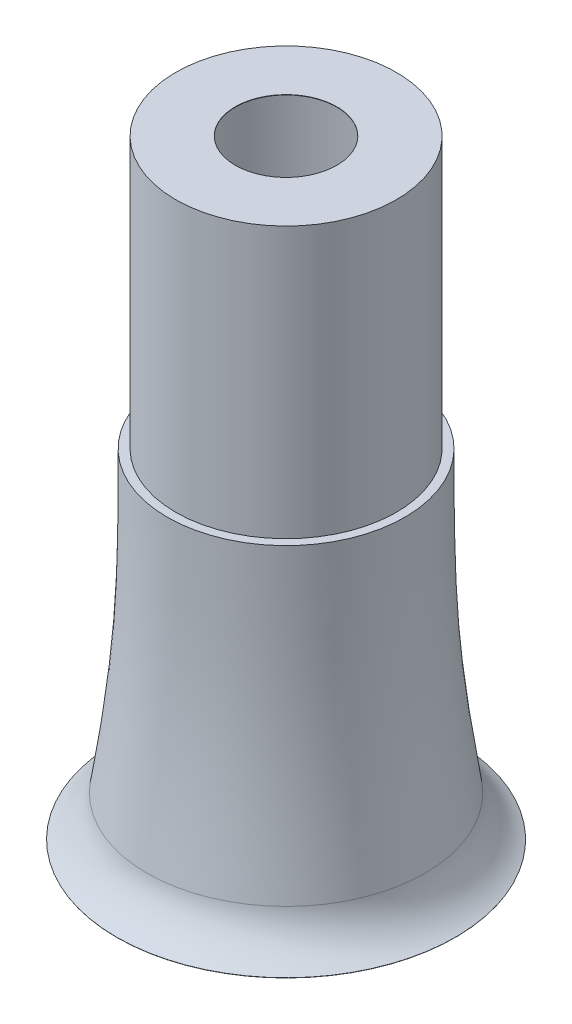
ISO-10303-21;
HEADER;
FILE_DESCRIPTION(('STEP AP214'),'2;1');
FILE_NAME('part.step','',(''),(''),'','','');
FILE_SCHEMA(('AUTOMOTIVE_DESIGN { 1 0 10303 214 1 1 1 1 }'));
ENDSEC;
DATA;
#1=APPLICATION_CONTEXT('core data for automotive mechanical design processes');
#2=APPLICATION_PROTOCOL_DEFINITION('international standard','automotive_design',2000,#1);
#3=PRODUCT_CONTEXT('',#1,'mechanical');
#4=PRODUCT('Part','Part','',(#3));
#5=PRODUCT_RELATED_PRODUCT_CATEGORY('part','',(#4));
#6=PRODUCT_DEFINITION_FORMATION('','',#4);
#7=PRODUCT_DEFINITION_CONTEXT('part definition',#1,'design');
#8=PRODUCT_DEFINITION('design','',#6,#7);
#9=PRODUCT_DEFINITION_SHAPE('','',#8);
#10=(LENGTH_UNIT() NAMED_UNIT(*) SI_UNIT(.MILLI.,.METRE.));
#11=(NAMED_UNIT(*) PLANE_ANGLE_UNIT() SI_UNIT($,.RADIAN.));
#12=(NAMED_UNIT(*) SI_UNIT($,.STERADIAN.) SOLID_ANGLE_UNIT());
#13=UNCERTAINTY_MEASURE_WITH_UNIT(LENGTH_MEASURE(1.E-05),#10,'distance_accuracy_value','');
#14=(GEOMETRIC_REPRESENTATION_CONTEXT(3) GLOBAL_UNCERTAINTY_ASSIGNED_CONTEXT((#13)) GLOBAL_UNIT_ASSIGNED_CONTEXT((#10,
#11,#12)) REPRESENTATION_CONTEXT('',''));
#15=CARTESIAN_POINT('',(0.,0.,0.));
#16=DIRECTION('',(0.,0.,1.));
#17=DIRECTION('',(1.,0.,0.));
#18=AXIS2_PLACEMENT_3D('',#15,#16,#17);
#19=CARTESIAN_POINT('',(0.,14.4799764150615,0.));
#20=DIRECTION('',(0.,1.,0.));
#21=DIRECTION('',(0.,0.,1.));
#22=AXIS2_PLACEMENT_3D('',#19,#20,#21);
#23=TOROIDAL_SURFACE('',#22,56.8066352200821,15.9);
#24=CARTESIAN_POINT('',(0.,0.0904998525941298,0.));
#25=DIRECTION('',(0.,1.,0.));
#26=DIRECTION('',(0.,0.,1.));
#27=AXIS2_PLACEMENT_3D('',#24,#25,#26);
#28=CIRCLE('',#27,50.0425414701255);
#29=CARTESIAN_POINT('',(0.,0.0904998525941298,50.0425414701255));
#30=VERTEX_POINT('',#29);
#31=EDGE_CURVE('E10',#30,#30,#28,.T.);
#32=ORIENTED_EDGE('',*,*,#31,.T.);
#33=EDGE_LOOP('',(#32));
#34=FACE_BOUND('',#33,.T.);
#35=CARTESIAN_POINT('',(0.,12.0154998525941,0.));
#36=DIRECTION('',(0.,1.,0.));
#37=DIRECTION('',(0.,0.,1.));
#38=AXIS2_PLACEMENT_3D('',#35,#36,#37);
#39=CIRCLE('',#38,41.0987914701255);
#40=CARTESIAN_POINT('',(0.,12.0154998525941,41.0987914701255));
#41=VERTEX_POINT('',#40);
#42=EDGE_CURVE('E76',#41,#41,#39,.T.);
#43=ORIENTED_EDGE('',*,*,#42,.F.);
#44=EDGE_LOOP('',(#43));
#45=FACE_BOUND('',#44,.T.);
#46=ADVANCED_FACE('F36',(#34,#45),#23,.F.);
#47=CARTESIAN_POINT('',(0.,0.,0.));
#48=DIRECTION('',(0.,1.,0.));
#49=DIRECTION('',(0.,0.,1.));
#50=AXIS2_PLACEMENT_3D('',#47,#48,#49);
#51=CONICAL_SURFACE('',#50,50.,0.439420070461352);
#52=ORIENTED_EDGE('',*,*,#31,.F.);
#53=EDGE_LOOP('',(#52));
#54=FACE_BOUND('',#53,.T.);
#55=CARTESIAN_POINT('',(0.,0.,0.));
#56=DIRECTION('',(0.,1.,0.));
#57=DIRECTION('',(0.,0.,1.));
#58=AXIS2_PLACEMENT_3D('',#55,#56,#57);
#59=CIRCLE('',#58,50.);
#60=CARTESIAN_POINT('',(0.,0.,50.));
#61=VERTEX_POINT('',#60);
#62=EDGE_CURVE('E42',#61,#61,#59,.T.);
#63=ORIENTED_EDGE('',*,*,#62,.T.);
#64=EDGE_LOOP('',(#63));
#65=FACE_BOUND('',#64,.T.);
#66=ADVANCED_FACE('F128',(#54,#65),#51,.T.);
#67=CARTESIAN_POINT('',(0.,14.4799764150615,0.));
#68=DIRECTION('',(0.,1.,0.));
#69=DIRECTION('',(0.,0.,1.));
#70=AXIS2_PLACEMENT_3D('',#67,#68,#69);
#71=TOROIDAL_SURFACE('',#70,56.8066352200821,16.);
#72=ORIENTED_EDGE('',*,*,#62,.F.);
#73=EDGE_LOOP('',(#72));
#74=FACE_BOUND('',#73,.T.);
#75=CARTESIAN_POINT('',(0.,12.,0.));
#76=DIRECTION('',(0.,1.,0.));
#77=DIRECTION('',(0.,0.,1.));
#78=AXIS2_PLACEMENT_3D('',#75,#76,#77);
#79=CIRCLE('',#78,41.);
#80=CARTESIAN_POINT('',(0.,12.,41.));
#81=VERTEX_POINT('',#80);
#82=EDGE_CURVE('E46',#81,#81,#79,.T.);
#83=ORIENTED_EDGE('',*,*,#82,.T.);
#84=EDGE_LOOP('',(#83));
#85=FACE_BOUND('',#84,.T.);
#86=ADVANCED_FACE('F125',(#74,#85),#71,.T.);
#87=CARTESIAN_POINT('',(0.,100.,35.));
#88=CARTESIAN_POINT('',(0.,63.9132988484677,35.));
#89=CARTESIAN_POINT('',(0.,47.6505825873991,35.4066145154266));
#90=CARTESIAN_POINT('',(0.,12.,41.));
#91=B_SPLINE_CURVE_WITH_KNOTS('',3,(#87,#88,#89,#90),.UNSPECIFIED.,.F.,.F.,(4,4),(0.,1.),.UNSPECIFIED.);
#92=CARTESIAN_POINT('',(0.,0.,0.));
#93=DIRECTION('',(0.,1.,0.));
#94=AXIS1_PLACEMENT('',#92,#93);
#95=SURFACE_OF_REVOLUTION('',#91,#94);
#96=ORIENTED_EDGE('',*,*,#82,.F.);
#97=EDGE_LOOP('',(#96));
#98=FACE_BOUND('',#97,.T.);
#99=CARTESIAN_POINT('',(0.,100.,0.));
#100=DIRECTION('',(0.,1.,0.));
#101=DIRECTION('',(0.,0.,1.));
#102=AXIS2_PLACEMENT_3D('',#99,#100,#101);
#103=CIRCLE('',#102,35.);
#104=CARTESIAN_POINT('',(0.,100.,35.));
#105=VERTEX_POINT('',#104);
#106=EDGE_CURVE('E50',#105,#105,#103,.T.);
#107=ORIENTED_EDGE('',*,*,#106,.T.);
#108=EDGE_LOOP('',(#107));
#109=FACE_BOUND('',#108,.T.);
#110=ADVANCED_FACE('F121',(#98,#109),#95,.T.);
#111=CARTESIAN_POINT('',(0.,100.,32.5));
#112=DIRECTION('',(0.,1.,0.));
#113=DIRECTION('',(0.,0.,1.));
#114=AXIS2_PLACEMENT_3D('',#111,#112,#113);
#115=PLANE('',#114);
#116=ORIENTED_EDGE('',*,*,#106,.F.);
#117=EDGE_LOOP('',(#116));
#118=FACE_BOUND('',#117,.T.);
#119=CARTESIAN_POINT('',(0.,100.,0.));
#120=DIRECTION('',(0.,1.,0.));
#121=DIRECTION('',(0.,0.,1.));
#122=AXIS2_PLACEMENT_3D('',#119,#120,#121);
#123=CIRCLE('',#122,32.5);
#124=CARTESIAN_POINT('',(0.,100.,32.5));
#125=VERTEX_POINT('',#124);
#126=EDGE_CURVE('E55',#125,#125,#123,.T.);
#127=ORIENTED_EDGE('',*,*,#126,.T.);
#128=EDGE_LOOP('',(#127));
#129=FACE_BOUND('',#128,.T.);
#130=ADVANCED_FACE('F117',(#118,#129),#115,.F.);
#131=CARTESIAN_POINT('',(0.,0.,0.));
#132=DIRECTION('',(0.,1.,0.));
#133=DIRECTION('',(0.,0.,1.));
#134=AXIS2_PLACEMENT_3D('',#131,#132,#133);
#135=CYLINDRICAL_SURFACE('',#134,32.5);
#136=ORIENTED_EDGE('',*,*,#126,.F.);
#137=EDGE_LOOP('',(#136));
#138=FACE_BOUND('',#137,.T.);
#139=CARTESIAN_POINT('',(0.,180.,0.));
#140=DIRECTION('',(0.,1.,0.));
#141=DIRECTION('',(0.,0.,1.));
#142=AXIS2_PLACEMENT_3D('',#139,#140,#141);
#143=CIRCLE('',#142,32.5);
#144=CARTESIAN_POINT('',(0.,180.,32.5));
#145=VERTEX_POINT('',#144);
#146=EDGE_CURVE('E58',#145,#145,#143,.T.);
#147=ORIENTED_EDGE('',*,*,#146,.T.);
#148=EDGE_LOOP('',(#147));
#149=FACE_BOUND('',#148,.T.);
#150=ADVANCED_FACE('F113',(#138,#149),#135,.F.);
#151=CARTESIAN_POINT('',(0.,180.,15.));
#152=DIRECTION('',(0.,1.,0.));
#153=DIRECTION('',(0.,0.,1.));
#154=AXIS2_PLACEMENT_3D('',#151,#152,#153);
#155=PLANE('',#154);
#156=ORIENTED_EDGE('',*,*,#146,.F.);
#157=EDGE_LOOP('',(#156));
#158=FACE_BOUND('',#157,.T.);
#159=CARTESIAN_POINT('',(0.,180.,0.));
#160=DIRECTION('',(0.,1.,0.));
#161=DIRECTION('',(0.,0.,1.));
#162=AXIS2_PLACEMENT_3D('',#159,#160,#161);
#163=CIRCLE('',#162,15.);
#164=CARTESIAN_POINT('',(0.,180.,15.));
#165=VERTEX_POINT('',#164);
#166=EDGE_CURVE('E61',#165,#165,#163,.T.);
#167=ORIENTED_EDGE('',*,*,#166,.T.);
#168=EDGE_LOOP('',(#167));
#169=FACE_BOUND('',#168,.T.);
#170=ADVANCED_FACE('F109',(#158,#169),#155,.F.);
#171=CARTESIAN_POINT('',(0.,0.,0.));
#172=DIRECTION('',(0.,1.,0.));
#173=DIRECTION('',(0.,0.,1.));
#174=AXIS2_PLACEMENT_3D('',#171,#172,#173);
#175=CYLINDRICAL_SURFACE('',#174,15.);
#176=ORIENTED_EDGE('',*,*,#166,.F.);
#177=EDGE_LOOP('',(#176));
#178=FACE_BOUND('',#177,.T.);
#179=CARTESIAN_POINT('',(0.,180.1,0.));
#180=DIRECTION('',(0.,1.,0.));
#181=DIRECTION('',(0.,0.,1.));
#182=AXIS2_PLACEMENT_3D('',#179,#180,#181);
#183=CIRCLE('',#182,15.);
#184=CARTESIAN_POINT('',(0.,180.1,15.));
#185=VERTEX_POINT('',#184);
#186=EDGE_CURVE('E64',#185,#185,#183,.T.);
#187=ORIENTED_EDGE('',*,*,#186,.T.);
#188=EDGE_LOOP('',(#187));
#189=FACE_BOUND('',#188,.T.);
#190=ADVANCED_FACE('F105',(#178,#189),#175,.F.);
#191=CARTESIAN_POINT('',(0.,180.1,15.));
#192=DIRECTION('',(0.,1.,0.));
#193=DIRECTION('',(0.,0.,1.));
#194=AXIS2_PLACEMENT_3D('',#191,#192,#193);
#195=PLANE('',#194);
#196=CARTESIAN_POINT('',(0.,180.1,0.));
#197=DIRECTION('',(0.,1.,0.));
#198=DIRECTION('',(0.,0.,1.));
#199=AXIS2_PLACEMENT_3D('',#196,#197,#198);
#200=CIRCLE('',#199,32.6);
#201=CARTESIAN_POINT('',(0.,180.1,32.6));
#202=VERTEX_POINT('',#201);
#203=EDGE_CURVE('E67',#202,#202,#200,.T.);
#204=ORIENTED_EDGE('',*,*,#203,.T.);
#205=EDGE_LOOP('',(#204));
#206=FACE_BOUND('',#205,.T.);
#207=ORIENTED_EDGE('',*,*,#186,.F.);
#208=EDGE_LOOP('',(#207));
#209=FACE_BOUND('',#208,.T.);
#210=ADVANCED_FACE('F101',(#206,#209),#195,.T.);
#211=CARTESIAN_POINT('',(0.,0.,0.));
#212=DIRECTION('',(0.,1.,0.));
#213=DIRECTION('',(0.,0.,1.));
#214=AXIS2_PLACEMENT_3D('',#211,#212,#213);
#215=CYLINDRICAL_SURFACE('',#214,32.6);
#216=CARTESIAN_POINT('',(0.,100.1,0.));
#217=DIRECTION('',(0.,1.,0.));
#218=DIRECTION('',(0.,0.,1.));
#219=AXIS2_PLACEMENT_3D('',#216,#217,#218);
#220=CIRCLE('',#219,32.6);
#221=CARTESIAN_POINT('',(0.,100.1,32.6));
#222=VERTEX_POINT('',#221);
#223=EDGE_CURVE('E70',#222,#222,#220,.T.);
#224=ORIENTED_EDGE('',*,*,#223,.T.);
#225=EDGE_LOOP('',(#224));
#226=FACE_BOUND('',#225,.T.);
#227=ORIENTED_EDGE('',*,*,#203,.F.);
#228=EDGE_LOOP('',(#227));
#229=FACE_BOUND('',#228,.T.);
#230=ADVANCED_FACE('F97',(#226,#229),#215,.T.);
#231=CARTESIAN_POINT('',(0.,100.1,32.5));
#232=DIRECTION('',(0.,1.,0.));
#233=DIRECTION('',(0.,0.,1.));
#234=AXIS2_PLACEMENT_3D('',#231,#232,#233);
#235=PLANE('',#234);
#236=CARTESIAN_POINT('',(0.,100.1,0.));
#237=DIRECTION('',(0.,1.,0.));
#238=DIRECTION('',(0.,0.,1.));
#239=AXIS2_PLACEMENT_3D('',#236,#237,#238);
#240=CIRCLE('',#239,35.1);
#241=CARTESIAN_POINT('',(0.,100.1,35.1));
#242=VERTEX_POINT('',#241);
#243=EDGE_CURVE('E73',#242,#242,#240,.T.);
#244=ORIENTED_EDGE('',*,*,#243,.T.);
#245=EDGE_LOOP('',(#244));
#246=FACE_BOUND('',#245,.T.);
#247=ORIENTED_EDGE('',*,*,#223,.F.);
#248=EDGE_LOOP('',(#247));
#249=FACE_BOUND('',#248,.T.);
#250=ADVANCED_FACE('F93',(#246,#249),#235,.T.);
#251=CARTESIAN_POINT('',(0.,100.1,35.1));
#252=CARTESIAN_POINT('',(0.,97.842497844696,35.1));
#253=CARTESIAN_POINT('',(0.,95.6582936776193,35.1014815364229));
#254=CARTESIAN_POINT('',(0.,91.4305745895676,35.110024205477));
#255=CARTESIAN_POINT('',(0.,85.2934349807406,35.1310704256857));
#256=CARTESIAN_POINT('',(0.,79.6832482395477,35.1873438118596));
#257=CARTESIAN_POINT('',(0.,68.9351196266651,35.3749337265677));
#258=CARTESIAN_POINT('',(0.,62.3993981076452,35.600047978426));
#259=CARTESIAN_POINT('',(0.,42.8372865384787,36.8001302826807));
#260=CARTESIAN_POINT('',(0.,29.8553209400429,38.2998190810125));
#261=CARTESIAN_POINT('',(0.,12.0154998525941,41.0987914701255));
#262=B_SPLINE_CURVE_WITH_KNOTS('',3,(#251,#252,#253,#254,#255,#256,#257,#258,#259,#260,#261),
.UNSPECIFIED.,.F.,.F.,(4,2,1,2,2,4),(0.,0.0625000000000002,0.125,0.25,0.5,1.),.UNSPECIFIED.);
#263=CARTESIAN_POINT('',(0.,0.,0.));
#264=DIRECTION('',(0.,1.,0.));
#265=AXIS1_PLACEMENT('',#263,#264);
#266=SURFACE_OF_REVOLUTION('',#262,#265);
#267=ORIENTED_EDGE('',*,*,#42,.T.);
#268=EDGE_LOOP('',(#267));
#269=FACE_BOUND('',#268,.T.);
#270=ORIENTED_EDGE('',*,*,#243,.F.);
#271=EDGE_LOOP('',(#270));
#272=FACE_BOUND('',#271,.T.);
#273=ADVANCED_FACE('F90',(#269,#272),#266,.F.);
#274=CLOSED_SHELL('',(#46,#66,#86,#110,#130,#150,#170,#190,#210,#230,#250,#273));
#275=MANIFOLD_SOLID_BREP('B2',#274);
#276=ADVANCED_BREP_SHAPE_REPRESENTATION('',(#18,#275),#14);
#277=SHAPE_DEFINITION_REPRESENTATION(#9,#276);
ENDSEC;
END-ISO-10303-21;
